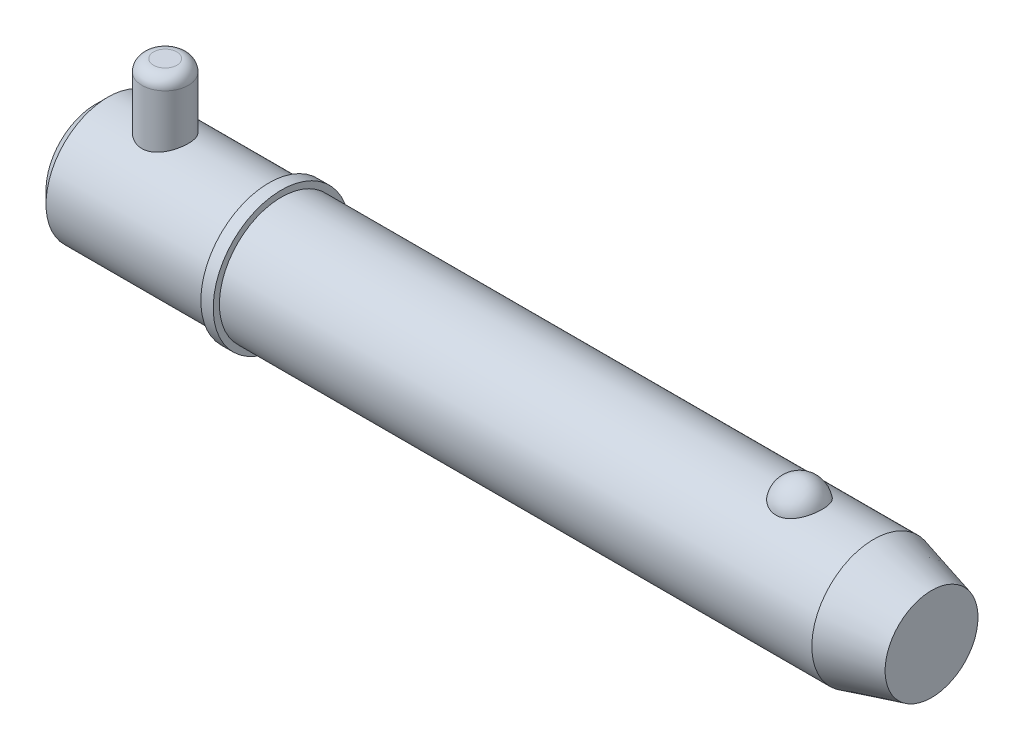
ISO-10303-21;
HEADER;
FILE_DESCRIPTION(('STEP AP214'),'2;1');
FILE_NAME('part.step','',(''),(''),'','','');
FILE_SCHEMA(('AUTOMOTIVE_DESIGN { 1 0 10303 214 1 1 1 1 }'));
ENDSEC;
DATA;
#1=APPLICATION_CONTEXT('core data for automotive mechanical design processes');
#2=APPLICATION_PROTOCOL_DEFINITION('international standard','automotive_design',2000,#1);
#3=PRODUCT_CONTEXT('',#1,'mechanical');
#4=PRODUCT('Part','Part','',(#3));
#5=PRODUCT_RELATED_PRODUCT_CATEGORY('part','',(#4));
#6=PRODUCT_DEFINITION_FORMATION('','',#4);
#7=PRODUCT_DEFINITION_CONTEXT('part definition',#1,'design');
#8=PRODUCT_DEFINITION('design','',#6,#7);
#9=PRODUCT_DEFINITION_SHAPE('','',#8);
#10=(LENGTH_UNIT() NAMED_UNIT(*) SI_UNIT(.MILLI.,.METRE.));
#11=(NAMED_UNIT(*) PLANE_ANGLE_UNIT() SI_UNIT($,.RADIAN.));
#12=(NAMED_UNIT(*) SI_UNIT($,.STERADIAN.) SOLID_ANGLE_UNIT());
#13=UNCERTAINTY_MEASURE_WITH_UNIT(LENGTH_MEASURE(1.E-05),#10,'distance_accuracy_value','');
#14=(GEOMETRIC_REPRESENTATION_CONTEXT(3) GLOBAL_UNCERTAINTY_ASSIGNED_CONTEXT((#13)) GLOBAL_UNIT_ASSIGNED_CONTEXT((#10,
#11,#12)) REPRESENTATION_CONTEXT('',''));
#15=CARTESIAN_POINT('',(0.,0.,0.));
#16=DIRECTION('',(0.,0.,1.));
#17=DIRECTION('',(1.,0.,0.));
#18=AXIS2_PLACEMENT_3D('',#15,#16,#17);
#19=CARTESIAN_POINT('',(14.28,25.4,0.));
#20=DIRECTION('',(0.,-1.,0.));
#21=DIRECTION('',(0.,0.,-1.));
#22=AXIS2_PLACEMENT_3D('',#19,#20,#21);
#23=CYLINDRICAL_SURFACE('',#22,4.76);
#24=CARTESIAN_POINT('',(14.28,-10.32,0.));
#25=DIRECTION('',(0.,1.,0.));
#26=DIRECTION('',(0.,0.,1.));
#27=AXIS2_PLACEMENT_3D('',#24,#25,#26);
#28=CIRCLE('',#27,4.76);
#29=CARTESIAN_POINT('',(14.28,-10.32,-4.76));
#30=VERTEX_POINT('',#29);
#31=EDGE_CURVE('P0_E25',#30,#30,#28,.T.);
#32=CARTESIAN_POINT('',(14.28,23.02,0.));
#33=DIRECTION('',(0.,1.,0.));
#34=DIRECTION('',(0.,0.,1.));
#35=AXIS2_PLACEMENT_3D('',#32,#33,#34);
#36=CIRCLE('',#35,4.76);
#37=CARTESIAN_POINT('',(14.28,23.02,-4.76));
#38=VERTEX_POINT('',#37);
#39=EDGE_CURVE('P0_E29',#38,#38,#36,.F.);
#40=CARTESIAN_POINT('',(14.28,-10.32,-4.76));
#41=CARTESIAN_POINT('',(14.28,-9.97270833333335,-4.76));
#42=CARTESIAN_POINT('',(14.28,-9.62541666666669,-4.76));
#43=CARTESIAN_POINT('',(14.28,-8.93083333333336,-4.76));
#44=CARTESIAN_POINT('',(14.28,-8.58354166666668,-4.76));
#45=CARTESIAN_POINT('',(14.28,-7.88895833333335,-4.76));
#46=CARTESIAN_POINT('',(14.28,-7.54166666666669,-4.76));
#47=CARTESIAN_POINT('',(14.28,-6.84708333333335,-4.76));
#48=CARTESIAN_POINT('',(14.28,-6.49979166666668,-4.76));
#49=CARTESIAN_POINT('',(14.28,-5.80520833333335,-4.76));
#50=CARTESIAN_POINT('',(14.28,-5.45791666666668,-4.76));
#51=CARTESIAN_POINT('',(14.28,-4.76333333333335,-4.76));
#52=CARTESIAN_POINT('',(14.28,-4.41604166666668,-4.76));
#53=CARTESIAN_POINT('',(14.28,-3.72145833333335,-4.76));
#54=CARTESIAN_POINT('',(14.28,-3.37416666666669,-4.76));
#55=CARTESIAN_POINT('',(14.28,-2.67958333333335,-4.76));
#56=CARTESIAN_POINT('',(14.28,-2.33229166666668,-4.76));
#57=CARTESIAN_POINT('',(14.28,-1.63770833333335,-4.76));
#58=CARTESIAN_POINT('',(14.28,-1.29041666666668,-4.76));
#59=CARTESIAN_POINT('',(14.28,-0.595833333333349,-4.76));
#60=CARTESIAN_POINT('',(14.28,-0.24854166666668,-4.76));
#61=CARTESIAN_POINT('',(14.28,0.446041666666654,-4.76));
#62=CARTESIAN_POINT('',(14.28,0.793333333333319,-4.76));
#63=CARTESIAN_POINT('',(14.28,1.48791666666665,-4.76));
#64=CARTESIAN_POINT('',(14.28,1.83520833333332,-4.76));
#65=CARTESIAN_POINT('',(14.28,2.52979166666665,-4.76));
#66=CARTESIAN_POINT('',(14.28,2.87708333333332,-4.76));
#67=CARTESIAN_POINT('',(14.28,3.57166666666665,-4.76));
#68=CARTESIAN_POINT('',(14.28,3.91895833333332,-4.76));
#69=CARTESIAN_POINT('',(14.28,4.61354166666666,-4.76));
#70=CARTESIAN_POINT('',(14.28,4.96083333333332,-4.76));
#71=CARTESIAN_POINT('',(14.28,5.65541666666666,-4.76));
#72=CARTESIAN_POINT('',(14.28,6.00270833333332,-4.76));
#73=CARTESIAN_POINT('',(14.28,6.69729166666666,-4.76));
#74=CARTESIAN_POINT('',(14.28,7.04458333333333,-4.76));
#75=CARTESIAN_POINT('',(14.28,7.73916666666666,-4.76));
#76=CARTESIAN_POINT('',(14.28,8.08645833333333,-4.76));
#77=CARTESIAN_POINT('',(14.28,8.78104166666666,-4.76));
#78=CARTESIAN_POINT('',(14.28,9.12833333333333,-4.76));
#79=CARTESIAN_POINT('',(14.28,9.82291666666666,-4.76));
#80=CARTESIAN_POINT('',(14.28,10.1702083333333,-4.76));
#81=CARTESIAN_POINT('',(14.28,10.8647916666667,-4.76));
#82=CARTESIAN_POINT('',(14.28,11.2120833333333,-4.76));
#83=CARTESIAN_POINT('',(14.28,11.9066666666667,-4.76));
#84=CARTESIAN_POINT('',(14.28,12.2539583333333,-4.76));
#85=CARTESIAN_POINT('',(14.28,12.9485416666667,-4.76));
#86=CARTESIAN_POINT('',(14.28,13.2958333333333,-4.76));
#87=CARTESIAN_POINT('',(14.28,13.9904166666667,-4.76));
#88=CARTESIAN_POINT('',(14.28,14.3377083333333,-4.76));
#89=CARTESIAN_POINT('',(14.28,15.0322916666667,-4.76));
#90=CARTESIAN_POINT('',(14.28,15.3795833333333,-4.76));
#91=CARTESIAN_POINT('',(14.28,16.0741666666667,-4.76));
#92=CARTESIAN_POINT('',(14.28,16.4214583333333,-4.76));
#93=CARTESIAN_POINT('',(14.28,17.1160416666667,-4.76));
#94=CARTESIAN_POINT('',(14.28,17.4633333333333,-4.76));
#95=CARTESIAN_POINT('',(14.28,18.1579166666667,-4.76));
#96=CARTESIAN_POINT('',(14.28,18.5052083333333,-4.76));
#97=CARTESIAN_POINT('',(14.28,19.1997916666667,-4.76));
#98=CARTESIAN_POINT('',(14.28,19.5470833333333,-4.76));
#99=CARTESIAN_POINT('',(14.28,20.2416666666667,-4.76));
#100=CARTESIAN_POINT('',(14.28,20.5889583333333,-4.76));
#101=CARTESIAN_POINT('',(14.28,21.2835416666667,-4.76));
#102=CARTESIAN_POINT('',(14.28,21.6308333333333,-4.76));
#103=CARTESIAN_POINT('',(14.28,22.3254166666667,-4.76));
#104=CARTESIAN_POINT('',(14.28,22.6727083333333,-4.76));
#105=CARTESIAN_POINT('',(14.28,23.02,-4.76));
#106=B_SPLINE_CURVE_WITH_KNOTS('',3,(#40,#41,#42,#43,#44,#45,#46,#47,#48,#49,#50,#51,#52,#53,
#54,#55,#56,#57,#58,#59,#60,#61,#62,#63,#64,#65,#66,#67,#68,#69,#70,#71,#72,#73,#74,#75,#76,#77,
#78,#79,#80,#81,#82,#83,#84,#85,#86,#87,#88,#89,#90,#91,#92,#93,#94,#95,#96,#97,#98,#99,#100,
#101,#102,#103,#104,#105),.UNSPECIFIED.,.F.,.F.,(4,2,2,2,2,2,2,2,2,2,2,2,2,2,2,2,2,2,2,2,2,2,2,
2,2,2,2,2,2,2,2,2,4),(0.,1.041875,2.08375,3.125625,4.1675,5.209375,6.25125,7.293125,
8.33500000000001,9.376875,10.41875,11.460625,12.5025,13.544375,14.58625,15.628125,16.67,
17.711875,18.75375,19.795625,20.8375,21.879375,22.92125,23.963125,25.005,26.046875,27.08875,
28.130625,29.1725,30.214375,31.25625,32.298125,33.34),.UNSPECIFIED.);
#107=EDGE_CURVE('P0_BSEAM14',#30,#38,#106,.T.);
#108=ORIENTED_EDGE('',*,*,#31,.T.);
#109=ORIENTED_EDGE('',*,*,#39,.T.);
#110=ORIENTED_EDGE('',*,*,#107,.T.);
#111=ORIENTED_EDGE('',*,*,#107,.F.);
#112=EDGE_LOOP('',(#108,#110,#109,#111));
#113=FACE_BOUND('',#112,.T.);
#114=ADVANCED_FACE('P0_F14',(#113),#23,.T.);
#115=CARTESIAN_POINT('',(14.28,25.4,0.));
#116=DIRECTION('',(0.,1.,0.));
#117=DIRECTION('',(0.,0.,1.));
#118=AXIS2_PLACEMENT_3D('',#115,#116,#117);
#119=PLANE('',#118);
#120=CARTESIAN_POINT('',(14.28,25.4,0.));
#121=DIRECTION('',(0.,1.,0.));
#122=DIRECTION('',(0.,0.,1.));
#123=AXIS2_PLACEMENT_3D('',#120,#121,#122);
#124=CIRCLE('',#123,2.38);
#125=CARTESIAN_POINT('',(14.28,25.4,2.38));
#126=VERTEX_POINT('',#125);
#127=EDGE_CURVE('P0_E10',#126,#126,#124,.T.);
#128=ORIENTED_EDGE('',*,*,#127,.T.);
#129=EDGE_LOOP('',(#128));
#130=FACE_BOUND('',#129,.T.);
#131=ADVANCED_FACE('P0_F46',(#130),#119,.T.);
#132=CARTESIAN_POINT('',(14.28,-12.7,0.));
#133=DIRECTION('',(0.,1.,0.));
#134=DIRECTION('',(0.,0.,1.));
#135=AXIS2_PLACEMENT_3D('',#132,#133,#134);
#136=PLANE('',#135);
#137=CARTESIAN_POINT('',(14.28,-12.7,0.));
#138=DIRECTION('',(0.,1.,0.));
#139=DIRECTION('',(0.,0.,1.));
#140=AXIS2_PLACEMENT_3D('',#137,#138,#139);
#141=CIRCLE('',#140,2.38);
#142=CARTESIAN_POINT('',(14.28,-12.7,2.38));
#143=VERTEX_POINT('',#142);
#144=EDGE_CURVE('P0_E21',#143,#143,#141,.F.);
#145=ORIENTED_EDGE('',*,*,#144,.T.);
#146=EDGE_LOOP('',(#145));
#147=FACE_BOUND('',#146,.T.);
#148=ADVANCED_FACE('P0_F43',(#147),#136,.F.);
#149=CARTESIAN_POINT('',(14.28,-10.32,0.));
#150=DIRECTION('',(0.,1.,0.));
#151=DIRECTION('',(0.,0.,1.));
#152=AXIS2_PLACEMENT_3D('',#149,#150,#151);
#153=DEGENERATE_TOROIDAL_SURFACE('',#152,2.38,2.38,.T.);
#154=ORIENTED_EDGE('',*,*,#144,.F.);
#155=EDGE_LOOP('',(#154));
#156=FACE_BOUND('',#155,.T.);
#157=ORIENTED_EDGE('',*,*,#31,.F.);
#158=EDGE_LOOP('',(#157));
#159=FACE_BOUND('',#158,.T.);
#160=ADVANCED_FACE('P0_F38',(#156,#159),#153,.T.);
#161=CARTESIAN_POINT('',(14.28,23.02,0.));
#162=DIRECTION('',(0.,1.,0.));
#163=DIRECTION('',(0.,0.,1.));
#164=AXIS2_PLACEMENT_3D('',#161,#162,#163);
#165=DEGENERATE_TOROIDAL_SURFACE('',#164,2.38,2.38,.T.);
#166=ORIENTED_EDGE('',*,*,#39,.F.);
#167=EDGE_LOOP('',(#166));
#168=FACE_BOUND('',#167,.T.);
#169=ORIENTED_EDGE('',*,*,#127,.F.);
#170=EDGE_LOOP('',(#169));
#171=FACE_BOUND('',#170,.T.);
#172=ADVANCED_FACE('P0_F16',(#168,#171),#165,.T.);
#173=CLOSED_SHELL('',(#114,#131,#148,#160,#172));
#174=MANIFOLD_SOLID_BREP('P0_B1',#173);
#175=CARTESIAN_POINT('',(0.,0.,0.));
#176=DIRECTION('',(1.,0.,0.));
#177=DIRECTION('',(0.,0.,-1.));
#178=AXIS2_PLACEMENT_3D('',#175,#176,#177);
#179=CYLINDRICAL_SURFACE('',#178,12.7);
#180=CARTESIAN_POINT('',(159.600738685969,0.,0.));
#181=DIRECTION('',(1.,0.,0.));
#182=DIRECTION('',(0.,0.,-1.));
#183=AXIS2_PLACEMENT_3D('',#180,#181,#182);
#184=CIRCLE('',#183,12.7);
#185=CARTESIAN_POINT('',(159.600738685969,0.,-12.7));
#186=VERTEX_POINT('',#185);
#187=EDGE_CURVE('P1_E81',#186,#186,#184,.T.);
#188=ORIENTED_EDGE('',*,*,#187,.F.);
#189=EDGE_LOOP('',(#188));
#190=FACE_BOUND('',#189,.T.);
#191=CARTESIAN_POINT('',(38.1,0.,0.));
#192=DIRECTION('',(1.,0.,0.));
#193=DIRECTION('',(0.,0.,-1.));
#194=AXIS2_PLACEMENT_3D('',#191,#192,#193);
#195=CIRCLE('',#194,12.7);
#196=CARTESIAN_POINT('',(38.1,0.,-12.7));
#197=VERTEX_POINT('',#196);
#198=EDGE_CURVE('P1_E85',#197,#197,#195,.T.);
#199=ORIENTED_EDGE('',*,*,#198,.T.);
#200=EDGE_LOOP('',(#199));
#201=FACE_BOUND('',#200,.T.);
#202=CARTESIAN_POINT('',(144.360042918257,11.7500437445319,4.81938502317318));
#203=CARTESIAN_POINT('',(144.235088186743,11.7500430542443,4.81938571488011));
#204=CARTESIAN_POINT('',(144.110144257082,11.7520975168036,4.81438658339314));
#205=CARTESIAN_POINT('',(143.861142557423,11.760253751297,4.79442904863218));
#206=CARTESIAN_POINT('',(143.737085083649,11.7663568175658,4.77946746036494));
#207=CARTESIAN_POINT('',(143.490901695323,11.7824262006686,4.73971414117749));
#208=CARTESIAN_POINT('',(143.368774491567,11.7923898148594,4.71492928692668));
#209=CARTESIAN_POINT('',(143.127187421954,11.8158938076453,4.65571340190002));
#210=CARTESIAN_POINT('',(143.00772859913,11.8294355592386,4.6212786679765));
#211=CARTESIAN_POINT('',(142.772557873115,11.8596812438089,4.54309502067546));
#212=CARTESIAN_POINT('',(142.656839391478,11.8763792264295,4.49936361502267));
#213=CARTESIAN_POINT('',(142.429653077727,11.9124878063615,4.40287235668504));
#214=CARTESIAN_POINT('',(142.318186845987,11.9318994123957,4.35010914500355));
#215=CARTESIAN_POINT('',(141.991278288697,11.9934256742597,4.17881316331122));
#216=CARTESIAN_POINT('',(141.783127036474,12.038858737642,4.04720756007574));
#217=CARTESIAN_POINT('',(141.385850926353,12.1352173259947,3.748564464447));
#218=CARTESIAN_POINT('',(141.197443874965,12.1862630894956,3.58061821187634));
#219=CARTESIAN_POINT('',(140.850521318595,12.2875163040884,3.21600758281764));
#220=CARTESIAN_POINT('',(140.692011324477,12.3377235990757,3.0193379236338));
#221=CARTESIAN_POINT('',(140.40168878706,12.4344923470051,2.592916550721));
#222=CARTESIAN_POINT('',(140.271376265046,12.4807925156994,2.36208286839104));
#223=CARTESIAN_POINT('',(140.049407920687,12.5623454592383,1.88070399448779));
#224=CARTESIAN_POINT('',(139.957755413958,12.5975972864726,1.63015711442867));
#225=CARTESIAN_POINT('',(139.814046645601,12.6538414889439,1.1129886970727));
#226=CARTESIAN_POINT('',(139.762499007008,12.6746503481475,0.846205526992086));
#227=CARTESIAN_POINT('',(139.701977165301,12.699153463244,0.307085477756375));
#228=CARTESIAN_POINT('',(139.693001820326,12.7028481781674,0.0347487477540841));
#229=CARTESIAN_POINT('',(139.717731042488,12.6927785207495,-0.506073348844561));
#230=CARTESIAN_POINT('',(139.751189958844,12.6791146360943,-0.774571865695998));
#231=CARTESIAN_POINT('',(139.859687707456,12.635882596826,-1.30170246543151));
#232=CARTESIAN_POINT('',(139.93472729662,12.606314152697,-1.56033436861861));
#233=CARTESIAN_POINT('',(140.12500006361,12.5342328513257,-2.06083899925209));
#234=CARTESIAN_POINT('',(140.240287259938,12.4917026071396,-2.30268867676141));
#235=CARTESIAN_POINT('',(140.508704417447,12.3981123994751,-2.76259600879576));
#236=CARTESIAN_POINT('',(140.661837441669,12.3470517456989,-2.98065173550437));
#237=CARTESIAN_POINT('',(141.003507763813,12.2416045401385,-3.38786328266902));
#238=CARTESIAN_POINT('',(141.192201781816,12.1872040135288,-3.57688418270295));
#239=CARTESIAN_POINT('',(141.600239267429,12.0814086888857,-3.91941073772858));
#240=CARTESIAN_POINT('',(141.819580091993,12.0300136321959,-4.07291945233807));
#241=CARTESIAN_POINT('',(142.278375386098,11.9373542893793,-4.33691289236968));
#242=CARTESIAN_POINT('',(142.517304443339,11.8958982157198,-4.44824125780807));
#243=CARTESIAN_POINT('',(143.01243761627,11.8268116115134,-4.62881985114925));
#244=CARTESIAN_POINT('',(143.268635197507,11.7991758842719,-4.69808589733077));
#245=CARTESIAN_POINT('',(143.777164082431,11.7622209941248,-4.78983181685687));
#246=CARTESIAN_POINT('',(144.029041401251,11.7520502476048,-4.81449025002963));
#247=CARTESIAN_POINT('',(144.533573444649,11.7485796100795,-4.82295735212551));
#248=CARTESIAN_POINT('',(144.786228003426,11.7552763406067,-4.80677420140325));
#249=CARTESIAN_POINT('',(145.276834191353,11.7842584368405,-4.73525430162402));
#250=CARTESIAN_POINT('',(145.514998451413,11.8060486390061,-4.68116061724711));
#251=CARTESIAN_POINT('',(145.978489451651,11.8622750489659,-4.53678133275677));
#252=CARTESIAN_POINT('',(146.203815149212,11.8967122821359,-4.44649279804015));
#253=CARTESIAN_POINT('',(146.640801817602,11.9754603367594,-4.22987613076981));
#254=CARTESIAN_POINT('',(146.852057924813,12.0199699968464,-4.10280539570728));
#255=CARTESIAN_POINT('',(147.250601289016,12.1138028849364,-3.81685409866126));
#256=CARTESIAN_POINT('',(147.437883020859,12.163127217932,-3.65796622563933));
#257=CARTESIAN_POINT('',(147.793350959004,12.2642343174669,-3.30364864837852));
#258=CARTESIAN_POINT('',(147.960111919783,12.3160165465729,-3.10678783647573));
#259=CARTESIAN_POINT('',(148.259579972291,12.4142566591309,-2.68748409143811));
#260=CARTESIAN_POINT('',(148.392280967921,12.4607135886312,-2.4650365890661));
#261=CARTESIAN_POINT('',(148.624691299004,12.5450236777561,-1.9928951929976));
#262=CARTESIAN_POINT('',(148.723215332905,12.5825557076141,-1.74255918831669));
#263=CARTESIAN_POINT('',(148.879227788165,12.6431720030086,-1.22773734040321));
#264=CARTESIAN_POINT('',(148.936715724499,12.6662560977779,-0.963251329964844));
#265=CARTESIAN_POINT('',(149.009544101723,12.6956486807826,-0.427355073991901));
#266=CARTESIAN_POINT('',(149.024837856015,12.7019385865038,-0.155937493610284));
#267=CARTESIAN_POINT('',(149.012779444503,12.6970201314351,0.385928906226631));
#268=CARTESIAN_POINT('',(148.98542805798,12.6858120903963,0.656377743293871));
#269=CARTESIAN_POINT('',(148.913060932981,12.6568455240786,1.05454017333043));
#270=CARTESIAN_POINT('',(148.883796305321,12.6451962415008,1.185778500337));
#271=CARTESIAN_POINT('',(148.815022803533,12.6181819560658,1.4451380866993));
#272=CARTESIAN_POINT('',(148.775517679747,12.6028183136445,1.57326046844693));
#273=CARTESIAN_POINT('',(148.686439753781,12.5687547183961,1.82554978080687));
#274=CARTESIAN_POINT('',(148.636862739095,12.5500533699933,1.9497150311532));
#275=CARTESIAN_POINT('',(148.52792115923,12.5098093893,2.19314370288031));
#276=CARTESIAN_POINT('',(148.468560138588,12.4882677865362,2.31240887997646));
#277=CARTESIAN_POINT('',(148.33997128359,12.4427679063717,2.54593031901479));
#278=CARTESIAN_POINT('',(148.270688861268,12.4187964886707,2.66015396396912));
#279=CARTESIAN_POINT('',(148.122903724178,12.3691892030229,2.88202659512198));
#280=CARTESIAN_POINT('',(148.044404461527,12.3435539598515,2.98967802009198));
#281=CARTESIAN_POINT('',(147.878550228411,12.2912955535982,3.19774385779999));
#282=CARTESIAN_POINT('',(147.791191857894,12.2646720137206,3.298155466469));
#283=CARTESIAN_POINT('',(147.608161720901,12.2111945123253,3.49095035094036));
#284=CARTESIAN_POINT('',(147.512493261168,12.1843406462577,3.58333679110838));
#285=CARTESIAN_POINT('',(147.313627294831,12.1312249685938,3.75922876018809));
#286=CARTESIAN_POINT('',(147.210450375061,12.104961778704,3.84275713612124));
#287=CARTESIAN_POINT('',(146.99701336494,12.0537284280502,4.00056406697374));
#288=CARTESIAN_POINT('',(146.886756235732,12.028757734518,4.07484645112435));
#289=CARTESIAN_POINT('',(146.659755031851,11.9808306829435,4.21367959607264));
#290=CARTESIAN_POINT('',(146.543006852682,11.9578756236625,4.27822410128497));
#291=CARTESIAN_POINT('',(146.30394258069,11.9147184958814,4.39698483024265));
#292=CARTESIAN_POINT('',(146.181628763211,11.894515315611,4.45120522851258));
#293=CARTESIAN_POINT('',(145.922952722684,11.8561129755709,4.55255353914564));
#294=CARTESIAN_POINT('',(145.786223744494,11.8381764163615,4.59884858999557));
#295=CARTESIAN_POINT('',(145.508608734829,11.8069093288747,4.67853897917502));
#296=CARTESIAN_POINT('',(145.367724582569,11.7935767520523,4.71194005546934));
#297=CARTESIAN_POINT('',(145.08309446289,11.7720277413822,4.76552188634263));
#298=CARTESIAN_POINT('',(144.939348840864,11.7638106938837,4.78570422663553));
#299=CARTESIAN_POINT('',(144.650411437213,11.7528195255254,4.81263433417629));
#300=CARTESIAN_POINT('',(144.505219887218,11.7500445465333,4.81938421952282));
#301=CARTESIAN_POINT('',(144.360042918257,11.7500437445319,4.81938502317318));
#302=B_SPLINE_CURVE_WITH_KNOTS('',3,(#202,#203,#204,#205,#206,#207,#208,#209,#210,#211,#212,
#213,#214,#215,#216,#217,#218,#219,#220,#221,#222,#223,#224,#225,#226,#227,#228,#229,#230,#231,
#232,#233,#234,#235,#236,#237,#238,#239,#240,#241,#242,#243,#244,#245,#246,#247,#248,#249,#250,
#251,#252,#253,#254,#255,#256,#257,#258,#259,#260,#261,#262,#263,#264,#265,#266,#267,#268,#269,
#270,#271,#272,#273,#274,#275,#276,#277,#278,#279,#280,#281,#282,#283,#284,#285,#286,#287,#288,
#289,#290,#291,#292,#293,#294,#295,#296,#297,#298,#299,#300,#301),.UNSPECIFIED.,.T.,.F.,(4,2,2,
2,2,2,2,2,2,2,2,2,2,2,2,2,2,2,2,2,2,2,2,2,2,2,2,2,2,2,2,2,2,2,2,2,2,2,2,2,2,2,2,2,2,2,2,2,2,4),
(0.,0.374729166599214,0.749578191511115,1.12416526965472,1.49889629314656,1.87292776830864,
2.24709865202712,2.99481328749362,3.76399449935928,4.53331735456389,5.3368391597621,
6.14042986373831,6.95405296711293,7.76765424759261,8.57656703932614,9.38549455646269,
10.1955119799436,11.0055949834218,11.8193353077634,12.6330054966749,13.4294141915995,
14.2255231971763,14.9815786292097,15.7374826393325,16.4696948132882,17.2019663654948,
17.9501979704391,18.6986017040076,19.4844704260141,20.2704797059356,21.0815215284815,
21.8925729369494,22.7045213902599,23.5164550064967,23.9209608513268,24.3253187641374,
24.7298461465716,25.1342272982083,25.54092555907,25.9474719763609,26.3541750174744,
26.7607169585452,27.1661834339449,27.5714814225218,27.9770386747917,28.3824315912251,
28.8181206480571,29.2536155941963,29.6890582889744,30.1244323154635),.UNSPECIFIED.);
#303=CARTESIAN_POINT('',(144.360042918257,11.7500437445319,4.81938502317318));
#304=VERTEX_POINT('',#303);
#305=EDGE_CURVE('P1_E35',#304,#304,#302,.T.);
#306=ORIENTED_EDGE('',*,*,#305,.T.);
#307=EDGE_LOOP('',(#306));
#308=FACE_BOUND('',#307,.T.);
#309=ADVANCED_FACE('P1_F13',(#190,#201,#308),#179,.T.);
#310=CARTESIAN_POINT('',(0.,0.,0.));
#311=DIRECTION('',(-1.,0.,0.));
#312=DIRECTION('',(0.,0.,1.));
#313=AXIS2_PLACEMENT_3D('',#310,#311,#312);
#314=PLANE('',#313);
#315=CARTESIAN_POINT('',(0.,0.,0.));
#316=DIRECTION('',(1.,0.,0.));
#317=DIRECTION('',(0.,0.,-1.));
#318=AXIS2_PLACEMENT_3D('',#315,#316,#317);
#319=CIRCLE('',#318,10.16);
#320=CARTESIAN_POINT('',(0.,0.,-10.16));
#321=VERTEX_POINT('',#320);
#322=EDGE_CURVE('P1_E9',#321,#321,#319,.T.);
#323=ORIENTED_EDGE('',*,*,#322,.F.);
#324=EDGE_LOOP('',(#323));
#325=FACE_BOUND('',#324,.T.);
#326=ADVANCED_FACE('P1_F15',(#325),#314,.T.);
#327=CARTESIAN_POINT('',(2.53999999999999,0.,0.));
#328=DIRECTION('',(1.,0.,0.));
#329=DIRECTION('',(0.,0.,-1.));
#330=AXIS2_PLACEMENT_3D('',#327,#328,#329);
#331=CONICAL_SURFACE('',#330,12.7,0.78539816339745);
#332=ORIENTED_EDGE('',*,*,#322,.T.);
#333=EDGE_LOOP('',(#332));
#334=FACE_BOUND('',#333,.T.);
#335=CARTESIAN_POINT('',(2.53999999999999,0.,0.));
#336=DIRECTION('',(1.,0.,0.));
#337=DIRECTION('',(0.,0.,-1.));
#338=AXIS2_PLACEMENT_3D('',#335,#336,#337);
#339=CIRCLE('',#338,12.7);
#340=CARTESIAN_POINT('',(2.53999999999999,0.,-12.7));
#341=VERTEX_POINT('',#340);
#342=EDGE_CURVE('P1_E26',#341,#341,#339,.T.);
#343=ORIENTED_EDGE('',*,*,#342,.F.);
#344=EDGE_LOOP('',(#343));
#345=FACE_BOUND('',#344,.T.);
#346=ADVANCED_FACE('P1_F77',(#334,#345),#331,.T.);
#347=CARTESIAN_POINT('',(0.,0.,0.));
#348=DIRECTION('',(1.,0.,0.));
#349=DIRECTION('',(0.,0.,-1.));
#350=AXIS2_PLACEMENT_3D('',#347,#348,#349);
#351=CYLINDRICAL_SURFACE('',#350,12.7);
#352=CARTESIAN_POINT('',(14.28,-11.7742260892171,4.76));
#353=CARTESIAN_POINT('',(14.1514948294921,-11.7742255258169,4.76000061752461));
#354=CARTESIAN_POINT('',(14.0229980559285,-11.7763355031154,4.75479194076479));
#355=CARTESIAN_POINT('',(13.7669369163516,-11.7847043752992,4.73401198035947));
#356=CARTESIAN_POINT('',(13.6393728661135,-11.7909646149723,4.71843733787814));
#357=CARTESIAN_POINT('',(13.386226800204,-11.8074248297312,4.67709434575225));
#358=CARTESIAN_POINT('',(13.2606439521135,-11.8176231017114,4.65133040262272));
#359=CARTESIAN_POINT('',(13.0122434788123,-11.8416347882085,4.58985545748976));
#360=CARTESIAN_POINT('',(12.8894269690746,-11.8554496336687,4.55414051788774));
#361=CARTESIAN_POINT('',(12.6477622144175,-11.8862222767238,4.47320764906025));
#362=CARTESIAN_POINT('',(12.5289037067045,-11.9031710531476,4.4280169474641));
#363=CARTESIAN_POINT('',(12.2955059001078,-11.939736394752,4.32845291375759));
#364=CARTESIAN_POINT('',(12.1809682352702,-11.9593539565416,4.2740761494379));
#365=CARTESIAN_POINT('',(11.8448901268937,-12.0213893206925,4.09777237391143));
#366=CARTESIAN_POINT('',(11.6307077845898,-12.0670135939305,3.9626122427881));
#367=CARTESIAN_POINT('',(11.2179129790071,-12.1641514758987,3.65386230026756));
#368=CARTESIAN_POINT('',(11.0204399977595,-12.2158379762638,3.47881300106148));
#369=CARTESIAN_POINT('',(10.6568212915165,-12.3178468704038,3.09829182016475));
#370=CARTESIAN_POINT('',(10.4906822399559,-12.3681689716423,2.89281347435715));
#371=CARTESIAN_POINT('',(10.1890299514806,-12.4638367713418,2.44867909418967));
#372=CARTESIAN_POINT('',(10.054749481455,-12.5089552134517,2.20913281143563));
#373=CARTESIAN_POINT('',(9.82886079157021,-12.5870472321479,1.70885919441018));
#374=CARTESIAN_POINT('',(9.73723778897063,-12.620025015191,1.44813923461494));
#375=CARTESIAN_POINT('',(9.60324488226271,-12.6688874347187,0.9248423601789));
#376=CARTESIAN_POINT('',(9.55892269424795,-12.6854474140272,0.662829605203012));
#377=CARTESIAN_POINT('',(9.5145335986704,-12.7020320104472,0.134596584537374));
#378=CARTESIAN_POINT('',(9.5144523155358,-12.7020619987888,-0.131622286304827));
#379=CARTESIAN_POINT('',(9.55741019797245,-12.6860129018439,-0.646717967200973));
#380=CARTESIAN_POINT('',(9.59831845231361,-12.6707298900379,-0.895801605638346));
#381=CARTESIAN_POINT('',(9.71850987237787,-12.6268158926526,-1.38327219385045));
#382=CARTESIAN_POINT('',(9.79779575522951,-12.5981839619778,-1.62165838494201));
#383=CARTESIAN_POINT('',(9.99348296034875,-12.5298894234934,-2.08508424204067));
#384=CARTESIAN_POINT('',(10.110407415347,-12.4900724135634,-2.30987931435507));
#385=CARTESIAN_POINT('',(10.3775896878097,-12.4034373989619,-2.7372158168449));
#386=CARTESIAN_POINT('',(10.5278582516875,-12.3566171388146,-2.93975004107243));
#387=CARTESIAN_POINT('',(10.8677318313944,-12.257571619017,-3.32936830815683));
#388=CARTESIAN_POINT('',(11.0591227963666,-12.2051903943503,-3.51485714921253));
#389=CARTESIAN_POINT('',(11.4706087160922,-12.1031155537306,-3.85170663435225));
#390=CARTESIAN_POINT('',(11.6907108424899,-12.0534226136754,-4.00305872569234));
#391=CARTESIAN_POINT('',(12.1596597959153,-11.9613684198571,-4.27038218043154));
#392=CARTESIAN_POINT('',(12.4090353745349,-11.9191939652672,-4.38549550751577));
#393=CARTESIAN_POINT('',(12.9256290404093,-11.8491124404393,-4.57149117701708));
#394=CARTESIAN_POINT('',(13.1928371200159,-11.8211974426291,-4.64239810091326));
#395=CARTESIAN_POINT('',(13.7217488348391,-11.7846654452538,-4.73434137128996));
#396=CARTESIAN_POINT('',(13.9829438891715,-11.7750694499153,-4.75791141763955));
#397=CARTESIAN_POINT('',(14.5056760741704,-11.7734909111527,-4.76182097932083));
#398=CARTESIAN_POINT('',(14.7672131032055,-11.7815039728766,-4.74217128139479));
#399=CARTESIAN_POINT('',(15.2702140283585,-11.8132466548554,-4.66249544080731));
#400=CARTESIAN_POINT('',(15.5120417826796,-11.8362133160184,-4.60442726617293));
#401=CARTESIAN_POINT('',(15.9824097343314,-11.8943704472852,-4.45202868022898));
#402=CARTESIAN_POINT('',(16.2109472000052,-11.9295634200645,-4.35769084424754));
#403=CARTESIAN_POINT('',(16.6577741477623,-12.0098310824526,-4.13144368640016));
#404=CARTESIAN_POINT('',(16.8753590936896,-12.055226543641,-3.99825937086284));
#405=CARTESIAN_POINT('',(17.2859732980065,-12.150238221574,-3.69949845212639));
#406=CARTESIAN_POINT('',(17.4789935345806,-12.19985597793,-3.5339100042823));
#407=CARTESIAN_POINT('',(17.8477707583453,-12.3015434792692,-3.1624728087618));
#408=CARTESIAN_POINT('',(18.0216609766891,-12.3535695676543,-2.95473880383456));
#409=CARTESIAN_POINT('',(18.254545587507,-12.426745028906,-2.62277433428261));
#410=CARTESIAN_POINT('',(18.3275489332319,-12.4503382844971,-2.50865480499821));
#411=CARTESIAN_POINT('',(18.463723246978,-12.4952713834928,-2.27428971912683));
#412=CARTESIAN_POINT('',(18.5268984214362,-12.5166121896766,-2.15404681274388));
#413=CARTESIAN_POINT('',(18.6427140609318,-12.5563817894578,-1.90858448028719));
#414=CARTESIAN_POINT('',(18.6953855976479,-12.5748191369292,-1.78338108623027));
#415=CARTESIAN_POINT('',(18.7899337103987,-12.6083284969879,-1.52857834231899));
#416=CARTESIAN_POINT('',(18.8318147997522,-12.6234019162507,-1.39898085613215));
#417=CARTESIAN_POINT('',(18.9043819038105,-12.6497495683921,-1.13633254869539));
#418=CARTESIAN_POINT('',(18.9350698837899,-12.6610244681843,-1.00328233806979));
#419=CARTESIAN_POINT('',(18.9849303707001,-12.6794412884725,-0.734761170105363));
#420=CARTESIAN_POINT('',(19.0041035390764,-12.6865834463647,-0.59929035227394));
#421=CARTESIAN_POINT('',(19.0299427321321,-12.6962286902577,-0.335006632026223));
#422=CARTESIAN_POINT('',(19.0372742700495,-12.698978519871,-0.206267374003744));
#423=CARTESIAN_POINT('',(19.0414668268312,-12.7005496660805,0.0514515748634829));
#424=CARTESIAN_POINT('',(19.038324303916,-12.69936965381,0.180431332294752));
#425=CARTESIAN_POINT('',(19.0215965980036,-12.6931114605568,0.437551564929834));
#426=CARTESIAN_POINT('',(19.0080165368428,-12.6880351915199,0.565692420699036));
#427=CARTESIAN_POINT('',(18.9705519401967,-12.6741222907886,0.820297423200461));
#428=CARTESIAN_POINT('',(18.9466635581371,-12.665284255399,0.946760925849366));
#429=CARTESIAN_POINT('',(18.8895279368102,-12.6443449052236,1.19395899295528));
#430=CARTESIAN_POINT('',(18.8565273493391,-12.6323299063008,1.3147578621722));
#431=CARTESIAN_POINT('',(18.781239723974,-12.6052503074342,1.55308888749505));
#432=CARTESIAN_POINT('',(18.738949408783,-12.5901846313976,1.67061987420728));
#433=CARTESIAN_POINT('',(18.5986461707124,-12.5409473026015,2.01714406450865));
#434=CARTESIAN_POINT('',(18.4871532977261,-12.502717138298,2.24027279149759));
#435=CARTESIAN_POINT('',(18.2262440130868,-12.4173042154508,2.6742599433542));
#436=CARTESIAN_POINT('',(18.0754310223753,-12.3698127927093,2.88420891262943));
#437=CARTESIAN_POINT('',(17.7421836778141,-12.271667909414,3.27675114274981));
#438=CARTESIAN_POINT('',(17.5597380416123,-12.2210133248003,3.45933459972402));
#439=CARTESIAN_POINT('',(17.2605468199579,-12.1452079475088,3.7138066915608));
#440=CARTESIAN_POINT('',(17.1535518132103,-12.119328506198,3.79719993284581));
#441=CARTESIAN_POINT('',(16.9326449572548,-12.0688597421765,3.95467398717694));
#442=CARTESIAN_POINT('',(16.8187356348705,-12.0442699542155,4.02875817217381));
#443=CARTESIAN_POINT('',(16.5846234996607,-11.9971053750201,4.16711104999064));
#444=CARTESIAN_POINT('',(16.4644172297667,-11.9745317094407,4.23137427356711));
#445=CARTESIAN_POINT('',(16.2185866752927,-11.9321360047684,4.34949041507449));
#446=CARTESIAN_POINT('',(16.09296473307,-11.9123127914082,4.40334777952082));
#447=CARTESIAN_POINT('',(15.8314769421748,-11.875268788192,4.50232278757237));
#448=CARTESIAN_POINT('',(15.6954035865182,-11.8582009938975,4.54695127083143));
#449=CARTESIAN_POINT('',(15.4194002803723,-11.8284328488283,4.62383807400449));
#450=CARTESIAN_POINT('',(15.2794720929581,-11.815730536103,4.6561019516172));
#451=CARTESIAN_POINT('',(14.9969657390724,-11.7951940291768,4.70788444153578));
#452=CARTESIAN_POINT('',(14.8543884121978,-11.7873583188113,4.72740702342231));
#453=CARTESIAN_POINT('',(14.5678704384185,-11.7768749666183,4.75346370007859));
#454=CARTESIAN_POINT('',(14.4239299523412,-11.7742267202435,4.75999930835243));
#455=CARTESIAN_POINT('',(14.28,-11.7742260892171,4.76));
#456=B_SPLINE_CURVE_WITH_KNOTS('',3,(#352,#353,#354,#355,#356,#357,#358,#359,#360,#361,#362,
#363,#364,#365,#366,#367,#368,#369,#370,#371,#372,#373,#374,#375,#376,#377,#378,#379,#380,#381,
#382,#383,#384,#385,#386,#387,#388,#389,#390,#391,#392,#393,#394,#395,#396,#397,#398,#399,#400,
#401,#402,#403,#404,#405,#406,#407,#408,#409,#410,#411,#412,#413,#414,#415,#416,#417,#418,#419,
#420,#421,#422,#423,#424,#425,#426,#427,#428,#429,#430,#431,#432,#433,#434,#435,#436,#437,#438,
#439,#440,#441,#442,#443,#444,#445,#446,#447,#448,#449,#450,#451,#452,#453,#454,#455),
.UNSPECIFIED.,.T.,.F.,(4,2,2,2,2,2,2,2,2,2,2,2,2,2,2,2,2,2,2,2,2,2,2,2,2,2,2,2,2,2,2,2,2,2,2,2,
2,2,2,2,2,2,2,2,2,2,2,2,2,2,2,4),(0.,0.385378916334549,0.770882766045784,1.15622008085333,
1.54171009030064,1.92610725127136,2.31064835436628,3.07917291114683,3.88239385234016,
4.68578566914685,5.51648193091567,6.34689010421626,7.14151420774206,7.93588010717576,
8.69098665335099,9.44614666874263,10.2122918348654,10.9786842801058,11.789876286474,
12.6012713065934,13.4306405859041,14.2595482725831,15.0427613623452,15.8257790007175,
16.5716820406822,17.3177378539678,18.0917395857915,18.8660247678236,19.6893332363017,
20.1014571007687,20.5134040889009,20.9241137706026,21.3346513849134,21.7451168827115,
22.1555587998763,22.542011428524,22.928594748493,23.3149884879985,23.7015265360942,
24.0784835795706,24.4555738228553,25.2091300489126,25.994347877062,26.7798463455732,
27.1937428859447,27.6074890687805,28.0214648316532,28.4352633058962,28.8672794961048,
29.299101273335,29.7307884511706,30.1624253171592),.UNSPECIFIED.);
#457=CARTESIAN_POINT('',(14.28,-11.7742260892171,4.76));
#458=VERTEX_POINT('',#457);
#459=EDGE_CURVE('P1_E17',#458,#458,#456,.T.);
#460=ORIENTED_EDGE('',*,*,#459,.F.);
#461=EDGE_LOOP('',(#460));
#462=FACE_BOUND('',#461,.T.);
#463=CARTESIAN_POINT('',(14.28,11.7742260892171,4.76));
#464=CARTESIAN_POINT('',(14.4085051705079,11.7742255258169,4.76000061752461));
#465=CARTESIAN_POINT('',(14.5370019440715,11.7763355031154,4.75479194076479));
#466=CARTESIAN_POINT('',(14.7930630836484,11.7847043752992,4.73401198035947));
#467=CARTESIAN_POINT('',(14.9206271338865,11.7909646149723,4.71843733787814));
#468=CARTESIAN_POINT('',(15.173773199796,11.8074248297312,4.67709434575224));
#469=CARTESIAN_POINT('',(15.2993560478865,11.8176231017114,4.65133040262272));
#470=CARTESIAN_POINT('',(15.5477565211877,11.8416347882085,4.58985545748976));
#471=CARTESIAN_POINT('',(15.6705730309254,11.8554496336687,4.55414051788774));
#472=CARTESIAN_POINT('',(15.9122377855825,11.8862222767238,4.47320764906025));
#473=CARTESIAN_POINT('',(16.0310962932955,11.9031710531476,4.4280169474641));
#474=CARTESIAN_POINT('',(16.2644940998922,11.939736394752,4.32845291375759));
#475=CARTESIAN_POINT('',(16.3790317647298,11.9593539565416,4.2740761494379));
#476=CARTESIAN_POINT('',(16.7151098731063,12.0213893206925,4.09777237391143));
#477=CARTESIAN_POINT('',(16.9292922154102,12.0670135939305,3.96261224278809));
#478=CARTESIAN_POINT('',(17.3420870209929,12.1641514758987,3.65386230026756));
#479=CARTESIAN_POINT('',(17.5395600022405,12.2158379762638,3.47881300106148));
#480=CARTESIAN_POINT('',(17.9031787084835,12.3178468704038,3.09829182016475));
#481=CARTESIAN_POINT('',(18.0693177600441,12.3681689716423,2.89281347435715));
#482=CARTESIAN_POINT('',(18.3709700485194,12.4638367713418,2.44867909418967));
#483=CARTESIAN_POINT('',(18.505250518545,12.5089552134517,2.20913281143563));
#484=CARTESIAN_POINT('',(18.7311392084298,12.5870472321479,1.70885919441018));
#485=CARTESIAN_POINT('',(18.8227622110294,12.620025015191,1.44813923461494));
#486=CARTESIAN_POINT('',(18.9567551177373,12.6688874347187,0.924842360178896));
#487=CARTESIAN_POINT('',(19.0010773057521,12.6854474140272,0.662829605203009));
#488=CARTESIAN_POINT('',(19.0454664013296,12.7020320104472,0.134596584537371));
#489=CARTESIAN_POINT('',(19.0455476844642,12.7020619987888,-0.13162228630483));
#490=CARTESIAN_POINT('',(19.0025898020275,12.6860129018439,-0.646717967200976));
#491=CARTESIAN_POINT('',(18.9616815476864,12.6707298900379,-0.89580160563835));
#492=CARTESIAN_POINT('',(18.8414901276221,12.6268158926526,-1.38327219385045));
#493=CARTESIAN_POINT('',(18.7622042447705,12.5981839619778,-1.62165838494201));
#494=CARTESIAN_POINT('',(18.5665170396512,12.5298894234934,-2.08508424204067));
#495=CARTESIAN_POINT('',(18.449592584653,12.4900724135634,-2.30987931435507));
#496=CARTESIAN_POINT('',(18.1824103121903,12.4034373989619,-2.7372158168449));
#497=CARTESIAN_POINT('',(18.0321417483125,12.3566171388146,-2.93975004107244));
#498=CARTESIAN_POINT('',(17.6922681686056,12.257571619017,-3.32936830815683));
#499=CARTESIAN_POINT('',(17.5008772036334,12.2051903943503,-3.51485714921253));
#500=CARTESIAN_POINT('',(17.0893912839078,12.1031155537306,-3.85170663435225));
#501=CARTESIAN_POINT('',(16.8692891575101,12.0534226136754,-4.00305872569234));
#502=CARTESIAN_POINT('',(16.4003402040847,11.9613684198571,-4.27038218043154));
#503=CARTESIAN_POINT('',(16.1509646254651,11.9191939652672,-4.38549550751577));
#504=CARTESIAN_POINT('',(15.6343709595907,11.8491124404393,-4.57149117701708));
#505=CARTESIAN_POINT('',(15.367162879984,11.8211974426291,-4.64239810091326));
#506=CARTESIAN_POINT('',(14.8382511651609,11.7846654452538,-4.73434137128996));
#507=CARTESIAN_POINT('',(14.5770561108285,11.7750694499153,-4.75791141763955));
#508=CARTESIAN_POINT('',(14.0543239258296,11.7734909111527,-4.76182097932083));
#509=CARTESIAN_POINT('',(13.7927868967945,11.7815039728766,-4.74217128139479));
#510=CARTESIAN_POINT('',(13.2897859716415,11.8132466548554,-4.66249544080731));
#511=CARTESIAN_POINT('',(13.0479582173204,11.8362133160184,-4.60442726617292));
#512=CARTESIAN_POINT('',(12.5775902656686,11.8943704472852,-4.45202868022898));
#513=CARTESIAN_POINT('',(12.3490527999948,11.9295634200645,-4.35769084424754));
#514=CARTESIAN_POINT('',(11.9022258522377,12.0098310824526,-4.13144368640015));
#515=CARTESIAN_POINT('',(11.6846409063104,12.055226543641,-3.99825937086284));
#516=CARTESIAN_POINT('',(11.2740267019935,12.150238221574,-3.69949845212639));
#517=CARTESIAN_POINT('',(11.0810064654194,12.19985597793,-3.5339100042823));
#518=CARTESIAN_POINT('',(10.7122292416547,12.3015434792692,-3.1624728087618));
#519=CARTESIAN_POINT('',(10.5383390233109,12.3535695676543,-2.95473880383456));
#520=CARTESIAN_POINT('',(10.305454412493,12.426745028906,-2.6227743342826));
#521=CARTESIAN_POINT('',(10.2324510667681,12.4503382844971,-2.50865480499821));
#522=CARTESIAN_POINT('',(10.096276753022,12.4952713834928,-2.27428971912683));
#523=CARTESIAN_POINT('',(10.0331015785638,12.5166121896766,-2.15404681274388));
#524=CARTESIAN_POINT('',(9.91728593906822,12.5563817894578,-1.90858448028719));
#525=CARTESIAN_POINT('',(9.8646144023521,12.5748191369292,-1.78338108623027));
#526=CARTESIAN_POINT('',(9.77006628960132,12.6083284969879,-1.52857834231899));
#527=CARTESIAN_POINT('',(9.72818520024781,12.6234019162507,-1.39898085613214));
#528=CARTESIAN_POINT('',(9.65561809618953,12.6497495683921,-1.13633254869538));
#529=CARTESIAN_POINT('',(9.62493011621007,12.6610244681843,-1.00328233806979));
#530=CARTESIAN_POINT('',(9.57506962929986,12.6794412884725,-0.734761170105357));
#531=CARTESIAN_POINT('',(9.55589646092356,12.6865834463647,-0.599290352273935));
#532=CARTESIAN_POINT('',(9.53005726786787,12.6962286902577,-0.335006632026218));
#533=CARTESIAN_POINT('',(9.52272572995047,12.698978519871,-0.20626737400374));
#534=CARTESIAN_POINT('',(9.51853317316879,12.7005496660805,0.0514515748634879));
#535=CARTESIAN_POINT('',(9.52167569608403,12.69936965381,0.180431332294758));
#536=CARTESIAN_POINT('',(9.53840340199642,12.6931114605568,0.43755156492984));
#537=CARTESIAN_POINT('',(9.55198346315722,12.6880351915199,0.565692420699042));
#538=CARTESIAN_POINT('',(9.58944805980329,12.6741222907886,0.820297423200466));
#539=CARTESIAN_POINT('',(9.61333644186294,12.665284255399,0.946760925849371));
#540=CARTESIAN_POINT('',(9.67047206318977,12.6443449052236,1.19395899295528));
#541=CARTESIAN_POINT('',(9.7034726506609,12.6323299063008,1.31475786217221));
#542=CARTESIAN_POINT('',(9.77876027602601,12.6052503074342,1.55308888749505));
#543=CARTESIAN_POINT('',(9.82105059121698,12.5901846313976,1.67061987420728));
#544=CARTESIAN_POINT('',(9.96135382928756,12.5409473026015,2.01714406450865));
#545=CARTESIAN_POINT('',(10.0728467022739,12.502717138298,2.24027279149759));
#546=CARTESIAN_POINT('',(10.3337559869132,12.4173042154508,2.6742599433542));
#547=CARTESIAN_POINT('',(10.4845689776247,12.3698127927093,2.88420891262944));
#548=CARTESIAN_POINT('',(10.8178163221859,12.271667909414,3.27675114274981));
#549=CARTESIAN_POINT('',(11.0002619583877,12.2210133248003,3.45933459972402));
#550=CARTESIAN_POINT('',(11.2994531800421,12.1452079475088,3.7138066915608));
#551=CARTESIAN_POINT('',(11.4064481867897,12.119328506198,3.79719993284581));
#552=CARTESIAN_POINT('',(11.6273550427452,12.0688597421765,3.95467398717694));
#553=CARTESIAN_POINT('',(11.7412643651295,12.0442699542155,4.02875817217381));
#554=CARTESIAN_POINT('',(11.9753765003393,11.9971053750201,4.16711104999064));
#555=CARTESIAN_POINT('',(12.0955827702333,11.9745317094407,4.23137427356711));
#556=CARTESIAN_POINT('',(12.3414133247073,11.9321360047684,4.34949041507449));
#557=CARTESIAN_POINT('',(12.46703526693,11.9123127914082,4.40334777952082));
#558=CARTESIAN_POINT('',(12.7285230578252,11.875268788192,4.50232278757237));
#559=CARTESIAN_POINT('',(12.8645964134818,11.8582009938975,4.54695127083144));
#560=CARTESIAN_POINT('',(13.1405997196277,11.8284328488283,4.62383807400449));
#561=CARTESIAN_POINT('',(13.2805279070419,11.815730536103,4.6561019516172));
#562=CARTESIAN_POINT('',(13.5630342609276,11.7951940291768,4.70788444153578));
#563=CARTESIAN_POINT('',(13.7056115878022,11.7873583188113,4.72740702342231));
#564=CARTESIAN_POINT('',(13.9921295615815,11.7768749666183,4.75346370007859));
#565=CARTESIAN_POINT('',(14.1360700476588,11.7742267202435,4.75999930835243));
#566=CARTESIAN_POINT('',(14.28,11.7742260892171,4.76));
#567=B_SPLINE_CURVE_WITH_KNOTS('',3,(#463,#464,#465,#466,#467,#468,#469,#470,#471,#472,#473,
#474,#475,#476,#477,#478,#479,#480,#481,#482,#483,#484,#485,#486,#487,#488,#489,#490,#491,#492,
#493,#494,#495,#496,#497,#498,#499,#500,#501,#502,#503,#504,#505,#506,#507,#508,#509,#510,#511,
#512,#513,#514,#515,#516,#517,#518,#519,#520,#521,#522,#523,#524,#525,#526,#527,#528,#529,#530,
#531,#532,#533,#534,#535,#536,#537,#538,#539,#540,#541,#542,#543,#544,#545,#546,#547,#548,#549,
#550,#551,#552,#553,#554,#555,#556,#557,#558,#559,#560,#561,#562,#563,#564,#565,#566),
.UNSPECIFIED.,.T.,.F.,(4,2,2,2,2,2,2,2,2,2,2,2,2,2,2,2,2,2,2,2,2,2,2,2,2,2,2,2,2,2,2,2,2,2,2,2,
2,2,2,2,2,2,2,2,2,2,2,2,2,2,2,4),(0.,0.385378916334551,0.770882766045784,1.15622008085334,
1.54171009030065,1.92610725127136,2.31064835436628,3.07917291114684,3.88239385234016,
4.68578566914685,5.51648193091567,6.34689010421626,7.14151420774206,7.93588010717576,
8.690986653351,9.44614666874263,10.2122918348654,10.9786842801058,11.789876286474,
12.6012713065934,13.4306405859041,14.2595482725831,15.0427613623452,15.8257790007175,
16.5716820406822,17.3177378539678,18.0917395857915,18.8660247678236,19.6893332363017,
20.1014571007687,20.5134040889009,20.9241137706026,21.3346513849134,21.7451168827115,
22.1555587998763,22.542011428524,22.928594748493,23.3149884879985,23.7015265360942,
24.0784835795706,24.4555738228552,25.2091300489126,25.994347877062,26.7798463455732,
27.1937428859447,27.6074890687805,28.0214648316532,28.4352633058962,28.8672794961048,
29.299101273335,29.7307884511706,30.1624253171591),.UNSPECIFIED.);
#568=CARTESIAN_POINT('',(14.28,11.7742260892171,4.76));
#569=VERTEX_POINT('',#568);
#570=EDGE_CURVE('P1_E43',#569,#569,#567,.T.);
#571=ORIENTED_EDGE('',*,*,#570,.F.);
#572=EDGE_LOOP('',(#571));
#573=FACE_BOUND('',#572,.T.);
#574=ORIENTED_EDGE('',*,*,#342,.T.);
#575=EDGE_LOOP('',(#574));
#576=FACE_BOUND('',#575,.T.);
#577=CARTESIAN_POINT('',(35.56,0.,0.));
#578=DIRECTION('',(1.,0.,0.));
#579=DIRECTION('',(0.,0.,-1.));
#580=AXIS2_PLACEMENT_3D('',#577,#578,#579);
#581=CIRCLE('',#580,12.7);
#582=CARTESIAN_POINT('',(35.56,0.,-12.7));
#583=VERTEX_POINT('',#582);
#584=EDGE_CURVE('P1_E31',#583,#583,#581,.T.);
#585=ORIENTED_EDGE('',*,*,#584,.F.);
#586=EDGE_LOOP('',(#585));
#587=FACE_BOUND('',#586,.T.);
#588=ADVANCED_FACE('P1_F103',(#462,#573,#576,#587),#351,.T.);
#589=CARTESIAN_POINT('',(35.56,12.7,0.));
#590=DIRECTION('',(-1.,0.,0.));
#591=DIRECTION('',(0.,0.,1.));
#592=AXIS2_PLACEMENT_3D('',#589,#590,#591);
#593=PLANE('',#592);
#594=ORIENTED_EDGE('',*,*,#584,.T.);
#595=EDGE_LOOP('',(#594));
#596=FACE_BOUND('',#595,.T.);
#597=CARTESIAN_POINT('',(35.56,0.,0.));
#598=DIRECTION('',(1.,0.,0.));
#599=DIRECTION('',(0.,0.,-1.));
#600=AXIS2_PLACEMENT_3D('',#597,#598,#599);
#601=CIRCLE('',#600,13.97);
#602=CARTESIAN_POINT('',(35.56,0.,-13.97));
#603=VERTEX_POINT('',#602);
#604=EDGE_CURVE('P1_E91',#603,#603,#601,.T.);
#605=ORIENTED_EDGE('',*,*,#604,.F.);
#606=EDGE_LOOP('',(#605));
#607=FACE_BOUND('',#606,.T.);
#608=ADVANCED_FACE('P1_F100',(#596,#607),#593,.T.);
#609=CARTESIAN_POINT('',(0.,0.,0.));
#610=DIRECTION('',(1.,0.,0.));
#611=DIRECTION('',(0.,0.,-1.));
#612=AXIS2_PLACEMENT_3D('',#609,#610,#611);
#613=CYLINDRICAL_SURFACE('',#612,13.97);
#614=ORIENTED_EDGE('',*,*,#604,.T.);
#615=EDGE_LOOP('',(#614));
#616=FACE_BOUND('',#615,.T.);
#617=CARTESIAN_POINT('',(38.1,0.,0.));
#618=DIRECTION('',(1.,0.,0.));
#619=DIRECTION('',(0.,0.,-1.));
#620=AXIS2_PLACEMENT_3D('',#617,#618,#619);
#621=CIRCLE('',#620,13.97);
#622=CARTESIAN_POINT('',(38.1,0.,-13.97));
#623=VERTEX_POINT('',#622);
#624=EDGE_CURVE('P1_E88',#623,#623,#621,.T.);
#625=ORIENTED_EDGE('',*,*,#624,.F.);
#626=EDGE_LOOP('',(#625));
#627=FACE_BOUND('',#626,.T.);
#628=ADVANCED_FACE('P1_F68',(#616,#627),#613,.T.);
#629=CARTESIAN_POINT('',(38.1,13.97,0.));
#630=DIRECTION('',(1.,0.,0.));
#631=DIRECTION('',(0.,0.,-1.));
#632=AXIS2_PLACEMENT_3D('',#629,#630,#631);
#633=PLANE('',#632);
#634=ORIENTED_EDGE('',*,*,#624,.T.);
#635=EDGE_LOOP('',(#634));
#636=FACE_BOUND('',#635,.T.);
#637=ORIENTED_EDGE('',*,*,#198,.F.);
#638=EDGE_LOOP('',(#637));
#639=FACE_BOUND('',#638,.T.);
#640=ADVANCED_FACE('P1_F62',(#636,#639),#633,.T.);
#641=CARTESIAN_POINT('',(171.45,0.,0.));
#642=DIRECTION('',(-1.,0.,0.));
#643=DIRECTION('',(0.,0.,1.));
#644=AXIS2_PLACEMENT_3D('',#641,#642,#643);
#645=CONICAL_SURFACE('',#644,9.52500000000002,0.26179938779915);
#646=ORIENTED_EDGE('',*,*,#187,.T.);
#647=EDGE_LOOP('',(#646));
#648=FACE_BOUND('',#647,.T.);
#649=CARTESIAN_POINT('',(171.45,0.,0.));
#650=DIRECTION('',(1.,0.,0.));
#651=DIRECTION('',(0.,0.,-1.));
#652=AXIS2_PLACEMENT_3D('',#649,#650,#651);
#653=CIRCLE('',#652,9.52500000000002);
#654=CARTESIAN_POINT('',(171.45,0.,-9.52500000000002));
#655=VERTEX_POINT('',#654);
#656=EDGE_CURVE('P1_E42',#655,#655,#653,.T.);
#657=ORIENTED_EDGE('',*,*,#656,.F.);
#658=EDGE_LOOP('',(#657));
#659=FACE_BOUND('',#658,.T.);
#660=ADVANCED_FACE('P1_F59',(#648,#659),#645,.T.);
#661=CARTESIAN_POINT('',(171.45,9.52500000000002,0.));
#662=DIRECTION('',(1.,0.,0.));
#663=DIRECTION('',(0.,0.,-1.));
#664=AXIS2_PLACEMENT_3D('',#661,#662,#663);
#665=PLANE('',#664);
#666=ORIENTED_EDGE('',*,*,#656,.T.);
#667=EDGE_LOOP('',(#666));
#668=FACE_BOUND('',#667,.T.);
#669=ADVANCED_FACE('P1_F55',(#668),#665,.T.);
#670=CARTESIAN_POINT('',(144.360042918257,11.43,0.));
#671=DIRECTION('',(-1.,0.,0.));
#672=DIRECTION('',(0.,1.,0.));
#673=AXIS2_PLACEMENT_3D('',#670,#671,#672);
#674=SPHERICAL_SURFACE('',#673,4.83);
#675=ORIENTED_EDGE('',*,*,#305,.F.);
#676=EDGE_LOOP('',(#675));
#677=FACE_BOUND('',#676,.T.);
#678=ADVANCED_FACE('P1_F50',(#677),#674,.T.);
#679=CARTESIAN_POINT('',(14.28,-13.97,0.));
#680=DIRECTION('',(0.,1.,0.));
#681=DIRECTION('',(0.,0.,1.));
#682=AXIS2_PLACEMENT_3D('',#679,#680,#681);
#683=CYLINDRICAL_SURFACE('',#682,4.76);
#684=ORIENTED_EDGE('',*,*,#459,.T.);
#685=EDGE_LOOP('',(#684));
#686=FACE_BOUND('',#685,.T.);
#687=ORIENTED_EDGE('',*,*,#570,.T.);
#688=EDGE_LOOP('',(#687));
#689=FACE_BOUND('',#688,.T.);
#690=ADVANCED_FACE('P1_F54',(#686,#689),#683,.F.);
#691=CLOSED_SHELL('',(#309,#326,#346,#588,#608,#628,#640,#660,#669,#678,#690));
#692=MANIFOLD_SOLID_BREP('P1_B1',#691);
#693=ADVANCED_BREP_SHAPE_REPRESENTATION('',(#18,#174,#692),#14);
#694=SHAPE_DEFINITION_REPRESENTATION(#9,#693);
ENDSEC;
END-ISO-10303-21;
